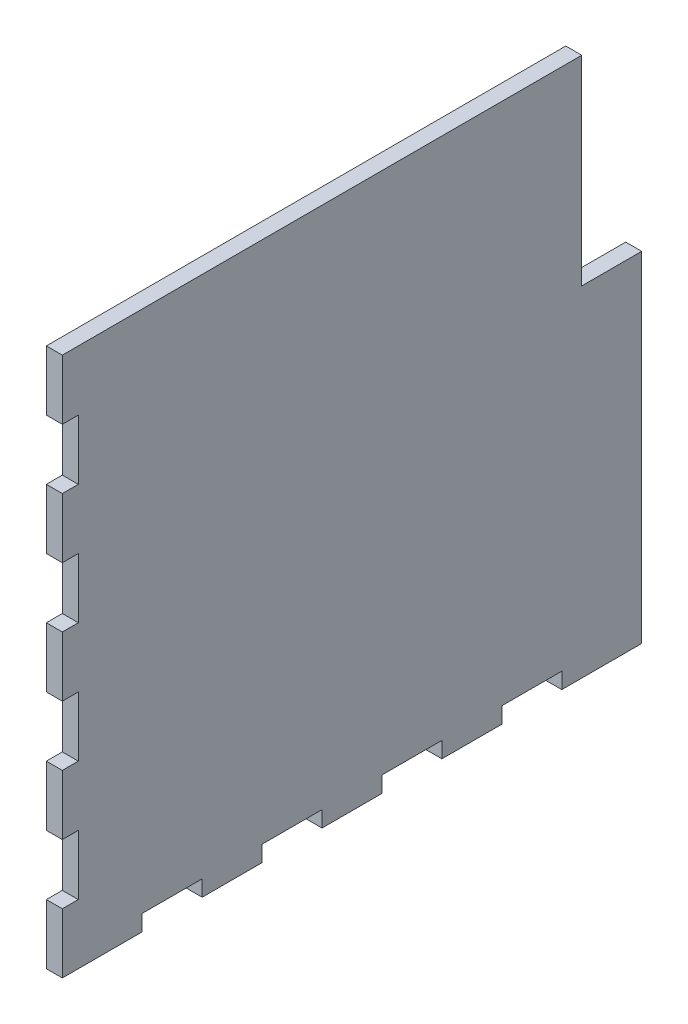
ISO-10303-21;
HEADER;
FILE_DESCRIPTION(('STEP AP214'),'2;1');
FILE_NAME('part.step','',(''),(''),'','','');
FILE_SCHEMA(('AUTOMOTIVE_DESIGN { 1 0 10303 214 1 1 1 1 }'));
ENDSEC;
DATA;
#1=APPLICATION_CONTEXT('core data for automotive mechanical design processes');
#2=APPLICATION_PROTOCOL_DEFINITION('international standard','automotive_design',2000,#1);
#3=PRODUCT_CONTEXT('',#1,'mechanical');
#4=PRODUCT('Part','Part','',(#3));
#5=PRODUCT_RELATED_PRODUCT_CATEGORY('part','',(#4));
#6=PRODUCT_DEFINITION_FORMATION('','',#4);
#7=PRODUCT_DEFINITION_CONTEXT('part definition',#1,'design');
#8=PRODUCT_DEFINITION('design','',#6,#7);
#9=PRODUCT_DEFINITION_SHAPE('','',#8);
#10=(LENGTH_UNIT() NAMED_UNIT(*) SI_UNIT(.MILLI.,.METRE.));
#11=(NAMED_UNIT(*) PLANE_ANGLE_UNIT() SI_UNIT($,.RADIAN.));
#12=(NAMED_UNIT(*) SI_UNIT($,.STERADIAN.) SOLID_ANGLE_UNIT());
#13=UNCERTAINTY_MEASURE_WITH_UNIT(LENGTH_MEASURE(1.E-05),#10,'distance_accuracy_value','');
#14=(GEOMETRIC_REPRESENTATION_CONTEXT(3) GLOBAL_UNCERTAINTY_ASSIGNED_CONTEXT((#13)) GLOBAL_UNIT_ASSIGNED_CONTEXT((#10,
#11,#12)) REPRESENTATION_CONTEXT('',''));
#15=CARTESIAN_POINT('',(0.,0.,0.));
#16=DIRECTION('',(0.,0.,1.));
#17=DIRECTION('',(1.,0.,0.));
#18=AXIS2_PLACEMENT_3D('',#15,#16,#17);
#19=CARTESIAN_POINT('',(4.,0.,0.));
#20=DIRECTION('',(0.,0.,1.));
#21=DIRECTION('',(0.,-1.,0.));
#22=AXIS2_PLACEMENT_3D('',#19,#20,#21);
#23=PLANE('',#22);
#24=DIRECTION('',(1.,0.,0.));
#25=VECTOR('',#24,1.);
#26=CARTESIAN_POINT('',(0.,120.,0.));
#27=LINE('',#26,#25);
#28=CARTESIAN_POINT('',(0.,120.,0.));
#29=VERTEX_POINT('',#28);
#30=CARTESIAN_POINT('',(4.,120.,0.));
#31=VERTEX_POINT('',#30);
#32=EDGE_CURVE('E664',#29,#31,#27,.T.);
#33=ORIENTED_EDGE('',*,*,#32,.T.);
#34=DIRECTION('',(0.,1.,0.));
#35=VECTOR('',#34,1.);
#36=CARTESIAN_POINT('',(4.,0.,0.));
#37=LINE('',#36,#35);
#38=CARTESIAN_POINT('',(4.,135.,0.));
#39=VERTEX_POINT('',#38);
#40=EDGE_CURVE('E528',#31,#39,#37,.T.);
#41=ORIENTED_EDGE('',*,*,#40,.T.);
#42=DIRECTION('',(-1.,0.,0.));
#43=VECTOR('',#42,1.);
#44=CARTESIAN_POINT('',(4.,135.,0.));
#45=LINE('',#44,#43);
#46=CARTESIAN_POINT('',(0.,135.,0.));
#47=VERTEX_POINT('',#46);
#48=EDGE_CURVE('E346',#39,#47,#45,.T.);
#49=ORIENTED_EDGE('',*,*,#48,.T.);
#50=DIRECTION('',(0.,1.,0.));
#51=VECTOR('',#50,1.);
#52=CARTESIAN_POINT('',(0.,0.,0.));
#53=LINE('',#52,#51);
#54=EDGE_CURVE('E322',#29,#47,#53,.T.);
#55=ORIENTED_EDGE('',*,*,#54,.F.);
#56=EDGE_LOOP('',(#33,#41,#49,#55));
#57=FACE_BOUND('',#56,.T.);
#58=ADVANCED_FACE('F45',(#57),#23,.T.);
#59=DIRECTION('',(1.,0.,0.));
#60=VECTOR('',#59,1.);
#61=CARTESIAN_POINT('',(0.,105.,0.));
#62=LINE('',#61,#60);
#63=CARTESIAN_POINT('',(0.,105.,0.));
#64=VERTEX_POINT('',#63);
#65=CARTESIAN_POINT('',(4.,105.,0.));
#66=VERTEX_POINT('',#65);
#67=EDGE_CURVE('E296',#64,#66,#62,.T.);
#68=ORIENTED_EDGE('',*,*,#67,.F.);
#69=CARTESIAN_POINT('',(0.,90.,0.));
#70=VERTEX_POINT('',#69);
#71=EDGE_CURVE('E309',#70,#64,#53,.T.);
#72=ORIENTED_EDGE('',*,*,#71,.F.);
#73=DIRECTION('',(1.,0.,0.));
#74=VECTOR('',#73,1.);
#75=CARTESIAN_POINT('',(0.,90.,0.));
#76=LINE('',#75,#74);
#77=CARTESIAN_POINT('',(4.,90.,0.));
#78=VERTEX_POINT('',#77);
#79=EDGE_CURVE('E714',#70,#78,#76,.T.);
#80=ORIENTED_EDGE('',*,*,#79,.T.);
#81=EDGE_CURVE('E311',#78,#66,#37,.T.);
#82=ORIENTED_EDGE('',*,*,#81,.T.);
#83=EDGE_LOOP('',(#68,#72,#80,#82));
#84=FACE_BOUND('',#83,.T.);
#85=ADVANCED_FACE('F307',(#84),#23,.T.);
#86=DIRECTION('',(1.,0.,0.));
#87=VECTOR('',#86,1.);
#88=CARTESIAN_POINT('',(0.,75.,0.));
#89=LINE('',#88,#87);
#90=CARTESIAN_POINT('',(0.,75.,0.));
#91=VERTEX_POINT('',#90);
#92=CARTESIAN_POINT('',(4.,75.,0.));
#93=VERTEX_POINT('',#92);
#94=EDGE_CURVE('E554',#91,#93,#89,.T.);
#95=ORIENTED_EDGE('',*,*,#94,.F.);
#96=CARTESIAN_POINT('',(0.,60.,0.));
#97=VERTEX_POINT('',#96);
#98=EDGE_CURVE('E321',#97,#91,#53,.T.);
#99=ORIENTED_EDGE('',*,*,#98,.F.);
#100=DIRECTION('',(1.,0.,0.));
#101=VECTOR('',#100,1.);
#102=CARTESIAN_POINT('',(0.,60.,0.));
#103=LINE('',#102,#101);
#104=CARTESIAN_POINT('',(4.,60.,0.));
#105=VERTEX_POINT('',#104);
#106=EDGE_CURVE('E555',#97,#105,#103,.T.);
#107=ORIENTED_EDGE('',*,*,#106,.T.);
#108=EDGE_CURVE('E539',#105,#93,#37,.T.);
#109=ORIENTED_EDGE('',*,*,#108,.T.);
#110=EDGE_LOOP('',(#95,#99,#107,#109));
#111=FACE_BOUND('',#110,.T.);
#112=ADVANCED_FACE('F552',(#111),#23,.T.);
#113=DIRECTION('',(1.,0.,0.));
#114=VECTOR('',#113,1.);
#115=CARTESIAN_POINT('',(0.,45.,0.));
#116=LINE('',#115,#114);
#117=CARTESIAN_POINT('',(0.,45.,0.));
#118=VERTEX_POINT('',#117);
#119=CARTESIAN_POINT('',(4.,45.,0.));
#120=VERTEX_POINT('',#119);
#121=EDGE_CURVE('E700',#118,#120,#116,.T.);
#122=ORIENTED_EDGE('',*,*,#121,.F.);
#123=CARTESIAN_POINT('',(0.,30.,0.));
#124=VERTEX_POINT('',#123);
#125=EDGE_CURVE('E327',#124,#118,#53,.T.);
#126=ORIENTED_EDGE('',*,*,#125,.F.);
#127=DIRECTION('',(1.,0.,0.));
#128=VECTOR('',#127,1.);
#129=CARTESIAN_POINT('',(0.,30.,0.));
#130=LINE('',#129,#128);
#131=CARTESIAN_POINT('',(4.,30.,0.));
#132=VERTEX_POINT('',#131);
#133=EDGE_CURVE('E726',#124,#132,#130,.T.);
#134=ORIENTED_EDGE('',*,*,#133,.T.);
#135=EDGE_CURVE('E532',#132,#120,#37,.T.);
#136=ORIENTED_EDGE('',*,*,#135,.T.);
#137=EDGE_LOOP('',(#122,#126,#134,#136));
#138=FACE_BOUND('',#137,.T.);
#139=ADVANCED_FACE('F747',(#138),#23,.T.);
#140=CARTESIAN_POINT('',(4.,0.,-145.));
#141=DIRECTION('',(0.,-1.,0.));
#142=DIRECTION('',(0.,0.,-1.));
#143=AXIS2_PLACEMENT_3D('',#140,#141,#142);
#144=PLANE('',#143);
#145=DIRECTION('',(1.,0.,0.));
#146=VECTOR('',#145,1.);
#147=CARTESIAN_POINT('',(0.,0.,-20.));
#148=LINE('',#147,#146);
#149=CARTESIAN_POINT('',(0.,0.,-20.));
#150=VERTEX_POINT('',#149);
#151=CARTESIAN_POINT('',(4.,0.,-20.));
#152=VERTEX_POINT('',#151);
#153=EDGE_CURVE('E601',#150,#152,#148,.T.);
#154=ORIENTED_EDGE('',*,*,#153,.T.);
#155=DIRECTION('',(0.,0.,1.));
#156=VECTOR('',#155,1.);
#157=CARTESIAN_POINT('',(4.,0.,-145.));
#158=LINE('',#157,#156);
#159=CARTESIAN_POINT('',(4.,0.,0.));
#160=VERTEX_POINT('',#159);
#161=EDGE_CURVE('E524',#152,#160,#158,.T.);
#162=ORIENTED_EDGE('',*,*,#161,.T.);
#163=DIRECTION('',(-1.,0.,0.));
#164=VECTOR('',#163,1.);
#165=CARTESIAN_POINT('',(4.,0.,0.));
#166=LINE('',#165,#164);
#167=CARTESIAN_POINT('',(0.,0.,0.));
#168=VERTEX_POINT('',#167);
#169=EDGE_CURVE('E350',#160,#168,#166,.T.);
#170=ORIENTED_EDGE('',*,*,#169,.T.);
#171=DIRECTION('',(0.,0.,1.));
#172=VECTOR('',#171,1.);
#173=CARTESIAN_POINT('',(0.,0.,-145.));
#174=LINE('',#173,#172);
#175=EDGE_CURVE('E383',#150,#168,#174,.T.);
#176=ORIENTED_EDGE('',*,*,#175,.F.);
#177=EDGE_LOOP('',(#154,#162,#170,#176));
#178=FACE_BOUND('',#177,.T.);
#179=ADVANCED_FACE('F652',(#178),#144,.T.);
#180=DIRECTION('',(1.,0.,0.));
#181=VECTOR('',#180,1.);
#182=CARTESIAN_POINT('',(0.,0.,-80.0000000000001));
#183=LINE('',#182,#181);
#184=CARTESIAN_POINT('',(0.,0.,-80.0000000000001));
#185=VERTEX_POINT('',#184);
#186=CARTESIAN_POINT('',(4.,0.,-80.0000000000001));
#187=VERTEX_POINT('',#186);
#188=EDGE_CURVE('E415',#185,#187,#183,.T.);
#189=ORIENTED_EDGE('',*,*,#188,.T.);
#190=CARTESIAN_POINT('',(4.,0.,-65.));
#191=VERTEX_POINT('',#190);
#192=EDGE_CURVE('E418',#187,#191,#158,.T.);
#193=ORIENTED_EDGE('',*,*,#192,.T.);
#194=DIRECTION('',(1.,0.,0.));
#195=VECTOR('',#194,1.);
#196=CARTESIAN_POINT('',(0.,0.,-65.));
#197=LINE('',#196,#195);
#198=CARTESIAN_POINT('',(0.,0.,-65.));
#199=VERTEX_POINT('',#198);
#200=EDGE_CURVE('E417',#199,#191,#197,.T.);
#201=ORIENTED_EDGE('',*,*,#200,.F.);
#202=EDGE_CURVE('E391',#185,#199,#174,.T.);
#203=ORIENTED_EDGE('',*,*,#202,.F.);
#204=EDGE_LOOP('',(#189,#193,#201,#203));
#205=FACE_BOUND('',#204,.T.);
#206=ADVANCED_FACE('F413',(#205),#144,.T.);
#207=DIRECTION('',(1.,0.,0.));
#208=VECTOR('',#207,1.);
#209=CARTESIAN_POINT('',(0.,0.,-95.0000000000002));
#210=LINE('',#209,#208);
#211=CARTESIAN_POINT('',(0.,0.,-95.0000000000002));
#212=VERTEX_POINT('',#211);
#213=CARTESIAN_POINT('',(4.,0.,-95.0000000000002));
#214=VERTEX_POINT('',#213);
#215=EDGE_CURVE('E618',#212,#214,#210,.T.);
#216=ORIENTED_EDGE('',*,*,#215,.F.);
#217=CARTESIAN_POINT('',(0.,0.,-110.));
#218=VERTEX_POINT('',#217);
#219=EDGE_CURVE('E393',#218,#212,#174,.T.);
#220=ORIENTED_EDGE('',*,*,#219,.F.);
#221=DIRECTION('',(1.,0.,0.));
#222=VECTOR('',#221,1.);
#223=CARTESIAN_POINT('',(0.,0.,-110.));
#224=LINE('',#223,#222);
#225=CARTESIAN_POINT('',(4.,0.,-110.));
#226=VERTEX_POINT('',#225);
#227=EDGE_CURVE('E448',#218,#226,#224,.T.);
#228=ORIENTED_EDGE('',*,*,#227,.T.);
#229=EDGE_CURVE('E529',#226,#214,#158,.T.);
#230=ORIENTED_EDGE('',*,*,#229,.T.);
#231=EDGE_LOOP('',(#216,#220,#228,#230));
#232=FACE_BOUND('',#231,.T.);
#233=ADVANCED_FACE('F639',(#232),#144,.T.);
#234=DIRECTION('',(1.,0.,0.));
#235=VECTOR('',#234,1.);
#236=CARTESIAN_POINT('',(0.,0.,-35.));
#237=LINE('',#236,#235);
#238=CARTESIAN_POINT('',(0.,0.,-35.));
#239=VERTEX_POINT('',#238);
#240=CARTESIAN_POINT('',(4.,0.,-35.));
#241=VERTEX_POINT('',#240);
#242=EDGE_CURVE('E609',#239,#241,#237,.T.);
#243=ORIENTED_EDGE('',*,*,#242,.F.);
#244=CARTESIAN_POINT('',(0.,0.,-50.));
#245=VERTEX_POINT('',#244);
#246=EDGE_CURVE('E386',#245,#239,#174,.T.);
#247=ORIENTED_EDGE('',*,*,#246,.F.);
#248=DIRECTION('',(1.,0.,0.));
#249=VECTOR('',#248,1.);
#250=CARTESIAN_POINT('',(0.,0.,-50.));
#251=LINE('',#250,#249);
#252=CARTESIAN_POINT('',(4.,0.,-50.));
#253=VERTEX_POINT('',#252);
#254=EDGE_CURVE('E422',#245,#253,#251,.T.);
#255=ORIENTED_EDGE('',*,*,#254,.T.);
#256=EDGE_CURVE('E643',#253,#241,#158,.T.);
#257=ORIENTED_EDGE('',*,*,#256,.T.);
#258=EDGE_LOOP('',(#243,#247,#255,#257));
#259=FACE_BOUND('',#258,.T.);
#260=ADVANCED_FACE('F789',(#259),#144,.T.);
#261=CARTESIAN_POINT('',(4.,85.,-130.));
#262=DIRECTION('',(0.,1.,0.));
#263=DIRECTION('',(0.,0.,1.));
#264=AXIS2_PLACEMENT_3D('',#261,#262,#263);
#265=PLANE('',#264);
#266=DIRECTION('',(0.,0.,-1.));
#267=VECTOR('',#266,1.);
#268=CARTESIAN_POINT('',(0.,85.,-130.));
#269=LINE('',#268,#267);
#270=CARTESIAN_POINT('',(0.,85.,-130.));
#271=VERTEX_POINT('',#270);
#272=CARTESIAN_POINT('',(0.,85.,-145.));
#273=VERTEX_POINT('',#272);
#274=EDGE_CURVE('E376',#271,#273,#269,.T.);
#275=ORIENTED_EDGE('',*,*,#274,.F.);
#276=DIRECTION('',(-1.,0.,0.));
#277=VECTOR('',#276,1.);
#278=CARTESIAN_POINT('',(4.,85.,-130.));
#279=LINE('',#278,#277);
#280=CARTESIAN_POINT('',(4.,85.,-130.));
#281=VERTEX_POINT('',#280);
#282=EDGE_CURVE('E11',#281,#271,#279,.T.);
#283=ORIENTED_EDGE('',*,*,#282,.F.);
#284=DIRECTION('',(0.,0.,-1.));
#285=VECTOR('',#284,1.);
#286=CARTESIAN_POINT('',(4.,85.,-130.));
#287=LINE('',#286,#285);
#288=CARTESIAN_POINT('',(4.,85.,-145.));
#289=VERTEX_POINT('',#288);
#290=EDGE_CURVE('E342',#281,#289,#287,.T.);
#291=ORIENTED_EDGE('',*,*,#290,.T.);
#292=DIRECTION('',(-1.,0.,0.));
#293=VECTOR('',#292,1.);
#294=CARTESIAN_POINT('',(4.,85.,-145.));
#295=LINE('',#294,#293);
#296=EDGE_CURVE('E49',#289,#273,#295,.T.);
#297=ORIENTED_EDGE('',*,*,#296,.T.);
#298=EDGE_LOOP('',(#275,#283,#291,#297));
#299=FACE_BOUND('',#298,.T.);
#300=ADVANCED_FACE('F47',(#299),#265,.T.);
#301=CARTESIAN_POINT('',(4.,135.,-130.));
#302=DIRECTION('',(0.,0.,-1.));
#303=DIRECTION('',(0.,1.,0.));
#304=AXIS2_PLACEMENT_3D('',#301,#302,#303);
#305=PLANE('',#304);
#306=DIRECTION('',(0.,-1.,0.));
#307=VECTOR('',#306,1.);
#308=CARTESIAN_POINT('',(0.,135.,-130.));
#309=LINE('',#308,#307);
#310=CARTESIAN_POINT('',(0.,135.,-130.));
#311=VERTEX_POINT('',#310);
#312=EDGE_CURVE('E339',#311,#271,#309,.T.);
#313=ORIENTED_EDGE('',*,*,#312,.F.);
#314=DIRECTION('',(-1.,0.,0.));
#315=VECTOR('',#314,1.);
#316=CARTESIAN_POINT('',(4.,135.,-130.));
#317=LINE('',#316,#315);
#318=CARTESIAN_POINT('',(4.,135.,-130.));
#319=VERTEX_POINT('',#318);
#320=EDGE_CURVE('E55',#319,#311,#317,.T.);
#321=ORIENTED_EDGE('',*,*,#320,.F.);
#322=DIRECTION('',(0.,-1.,0.));
#323=VECTOR('',#322,1.);
#324=CARTESIAN_POINT('',(4.,135.,-130.));
#325=LINE('',#324,#323);
#326=EDGE_CURVE('E360',#319,#281,#325,.T.);
#327=ORIENTED_EDGE('',*,*,#326,.T.);
#328=ORIENTED_EDGE('',*,*,#282,.T.);
#329=EDGE_LOOP('',(#313,#321,#327,#328));
#330=FACE_BOUND('',#329,.T.);
#331=ADVANCED_FACE('F786',(#330),#305,.T.);
#332=CARTESIAN_POINT('',(4.,135.,0.));
#333=DIRECTION('',(0.,1.,0.));
#334=DIRECTION('',(0.,0.,1.));
#335=AXIS2_PLACEMENT_3D('',#332,#333,#334);
#336=PLANE('',#335);
#337=DIRECTION('',(0.,0.,-1.));
#338=VECTOR('',#337,1.);
#339=CARTESIAN_POINT('',(0.,135.,0.));
#340=LINE('',#339,#338);
#341=EDGE_CURVE('E334',#47,#311,#340,.T.);
#342=ORIENTED_EDGE('',*,*,#341,.F.);
#343=ORIENTED_EDGE('',*,*,#48,.F.);
#344=DIRECTION('',(0.,0.,-1.));
#345=VECTOR('',#344,1.);
#346=CARTESIAN_POINT('',(4.,135.,0.));
#347=LINE('',#346,#345);
#348=EDGE_CURVE('E366',#39,#319,#347,.T.);
#349=ORIENTED_EDGE('',*,*,#348,.T.);
#350=ORIENTED_EDGE('',*,*,#320,.T.);
#351=EDGE_LOOP('',(#342,#343,#349,#350));
#352=FACE_BOUND('',#351,.T.);
#353=ADVANCED_FACE('F784',(#352),#336,.T.);
#354=DIRECTION('',(1.,0.,0.));
#355=VECTOR('',#354,1.);
#356=CARTESIAN_POINT('',(0.,15.,0.));
#357=LINE('',#356,#355);
#358=CARTESIAN_POINT('',(0.,15.,0.));
#359=VERTEX_POINT('',#358);
#360=CARTESIAN_POINT('',(4.,15.,0.));
#361=VERTEX_POINT('',#360);
#362=EDGE_CURVE('E715',#359,#361,#357,.T.);
#363=ORIENTED_EDGE('',*,*,#362,.F.);
#364=EDGE_CURVE('E329',#168,#359,#53,.T.);
#365=ORIENTED_EDGE('',*,*,#364,.F.);
#366=ORIENTED_EDGE('',*,*,#169,.F.);
#367=EDGE_CURVE('E372',#160,#361,#37,.T.);
#368=ORIENTED_EDGE('',*,*,#367,.T.);
#369=EDGE_LOOP('',(#363,#365,#366,#368));
#370=FACE_BOUND('',#369,.T.);
#371=ADVANCED_FACE('F654',(#370),#23,.T.);
#372=DIRECTION('',(1.,0.,0.));
#373=VECTOR('',#372,1.);
#374=CARTESIAN_POINT('',(0.,0.,-125.));
#375=LINE('',#374,#373);
#376=CARTESIAN_POINT('',(0.,0.,-125.));
#377=VERTEX_POINT('',#376);
#378=CARTESIAN_POINT('',(4.,0.,-125.));
#379=VERTEX_POINT('',#378);
#380=EDGE_CURVE('E453',#377,#379,#375,.T.);
#381=ORIENTED_EDGE('',*,*,#380,.F.);
#382=CARTESIAN_POINT('',(0.,0.,-145.));
#383=VERTEX_POINT('',#382);
#384=EDGE_CURVE('E328',#383,#377,#174,.T.);
#385=ORIENTED_EDGE('',*,*,#384,.F.);
#386=DIRECTION('',(-1.,0.,0.));
#387=VECTOR('',#386,1.);
#388=CARTESIAN_POINT('',(4.,0.,-145.));
#389=LINE('',#388,#387);
#390=CARTESIAN_POINT('',(4.,0.,-145.));
#391=VERTEX_POINT('',#390);
#392=EDGE_CURVE('E353',#391,#383,#389,.T.);
#393=ORIENTED_EDGE('',*,*,#392,.F.);
#394=EDGE_CURVE('E525',#391,#379,#158,.T.);
#395=ORIENTED_EDGE('',*,*,#394,.T.);
#396=EDGE_LOOP('',(#381,#385,#393,#395));
#397=FACE_BOUND('',#396,.T.);
#398=ADVANCED_FACE('F796',(#397),#144,.T.);
#399=CARTESIAN_POINT('',(4.,85.,-145.));
#400=DIRECTION('',(0.,0.,-1.));
#401=DIRECTION('',(0.,1.,0.));
#402=AXIS2_PLACEMENT_3D('',#399,#400,#401);
#403=PLANE('',#402);
#404=DIRECTION('',(0.,-1.,0.));
#405=VECTOR('',#404,1.);
#406=CARTESIAN_POINT('',(0.,85.,-145.));
#407=LINE('',#406,#405);
#408=EDGE_CURVE('E379',#273,#383,#407,.T.);
#409=ORIENTED_EDGE('',*,*,#408,.F.);
#410=ORIENTED_EDGE('',*,*,#296,.F.);
#411=DIRECTION('',(0.,-1.,0.));
#412=VECTOR('',#411,1.);
#413=CARTESIAN_POINT('',(4.,85.,-145.));
#414=LINE('',#413,#412);
#415=EDGE_CURVE('E521',#289,#391,#414,.T.);
#416=ORIENTED_EDGE('',*,*,#415,.T.);
#417=ORIENTED_EDGE('',*,*,#392,.T.);
#418=EDGE_LOOP('',(#409,#410,#416,#417));
#419=FACE_BOUND('',#418,.T.);
#420=ADVANCED_FACE('F810',(#419),#403,.T.);
#421=CARTESIAN_POINT('',(4.,0.,0.));
#422=DIRECTION('',(-1.,0.,0.));
#423=DIRECTION('',(0.,0.,1.));
#424=AXIS2_PLACEMENT_3D('',#421,#422,#423);
#425=PLANE('',#424);
#426=ORIENTED_EDGE('',*,*,#40,.F.);
#427=DIRECTION('',(0.,0.,-1.));
#428=VECTOR('',#427,1.);
#429=CARTESIAN_POINT('',(4.,120.,0.));
#430=LINE('',#429,#428);
#431=CARTESIAN_POINT('',(4.,120.,-4.));
#432=VERTEX_POINT('',#431);
#433=EDGE_CURVE('E586',#31,#432,#430,.T.);
#434=ORIENTED_EDGE('',*,*,#433,.T.);
#435=DIRECTION('',(0.,-1.,0.));
#436=VECTOR('',#435,1.);
#437=CARTESIAN_POINT('',(4.,0.,-4.00000000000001));
#438=LINE('',#437,#436);
#439=CARTESIAN_POINT('',(4.,105.,-4.));
#440=VERTEX_POINT('',#439);
#441=EDGE_CURVE('E582',#432,#440,#438,.T.);
#442=ORIENTED_EDGE('',*,*,#441,.T.);
#443=DIRECTION('',(0.,0.,1.));
#444=VECTOR('',#443,1.);
#445=CARTESIAN_POINT('',(4.,105.,0.));
#446=LINE('',#445,#444);
#447=EDGE_CURVE('E579',#440,#66,#446,.T.);
#448=ORIENTED_EDGE('',*,*,#447,.T.);
#449=ORIENTED_EDGE('',*,*,#81,.F.);
#450=DIRECTION('',(0.,0.,-1.));
#451=VECTOR('',#450,1.);
#452=CARTESIAN_POINT('',(4.,90.,0.));
#453=LINE('',#452,#451);
#454=CARTESIAN_POINT('',(4.,90.,-4.00000000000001));
#455=VERTEX_POINT('',#454);
#456=EDGE_CURVE('E571',#78,#455,#453,.T.);
#457=ORIENTED_EDGE('',*,*,#456,.T.);
#458=DIRECTION('',(0.,-1.,0.));
#459=VECTOR('',#458,1.);
#460=CARTESIAN_POINT('',(4.,0.,-4.00000000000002));
#461=LINE('',#460,#459);
#462=CARTESIAN_POINT('',(4.,75.,-4.00000000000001));
#463=VERTEX_POINT('',#462);
#464=EDGE_CURVE('E565',#455,#463,#461,.T.);
#465=ORIENTED_EDGE('',*,*,#464,.T.);
#466=DIRECTION('',(0.,0.,1.));
#467=VECTOR('',#466,1.);
#468=CARTESIAN_POINT('',(4.,75.,0.));
#469=LINE('',#468,#467);
#470=EDGE_CURVE('E563',#463,#93,#469,.T.);
#471=ORIENTED_EDGE('',*,*,#470,.T.);
#472=ORIENTED_EDGE('',*,*,#108,.F.);
#473=DIRECTION('',(0.,0.,-1.));
#474=VECTOR('',#473,1.);
#475=CARTESIAN_POINT('',(4.,60.,0.));
#476=LINE('',#475,#474);
#477=CARTESIAN_POINT('',(4.,60.,-4.00000000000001));
#478=VERTEX_POINT('',#477);
#479=EDGE_CURVE('E561',#105,#478,#476,.T.);
#480=ORIENTED_EDGE('',*,*,#479,.T.);
#481=DIRECTION('',(0.,-1.,0.));
#482=VECTOR('',#481,1.);
#483=CARTESIAN_POINT('',(4.,0.,-4.00000000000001));
#484=LINE('',#483,#482);
#485=CARTESIAN_POINT('',(4.,45.,-4.00000000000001));
#486=VERTEX_POINT('',#485);
#487=EDGE_CURVE('E573',#478,#486,#484,.T.);
#488=ORIENTED_EDGE('',*,*,#487,.T.);
#489=DIRECTION('',(0.,0.,1.));
#490=VECTOR('',#489,1.);
#491=CARTESIAN_POINT('',(4.,45.,0.));
#492=LINE('',#491,#490);
#493=EDGE_CURVE('E678',#486,#120,#492,.T.);
#494=ORIENTED_EDGE('',*,*,#493,.T.);
#495=ORIENTED_EDGE('',*,*,#135,.F.);
#496=DIRECTION('',(0.,0.,-1.));
#497=VECTOR('',#496,1.);
#498=CARTESIAN_POINT('',(4.,30.,0.));
#499=LINE('',#498,#497);
#500=CARTESIAN_POINT('',(4.,30.,-4.));
#501=VERTEX_POINT('',#500);
#502=EDGE_CURVE('E668',#132,#501,#499,.T.);
#503=ORIENTED_EDGE('',*,*,#502,.T.);
#504=DIRECTION('',(0.,-1.,0.));
#505=VECTOR('',#504,1.);
#506=CARTESIAN_POINT('',(4.,0.,-3.99999999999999));
#507=LINE('',#506,#505);
#508=CARTESIAN_POINT('',(4.,15.,-3.99999999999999));
#509=VERTEX_POINT('',#508);
#510=EDGE_CURVE('E659',#501,#509,#507,.T.);
#511=ORIENTED_EDGE('',*,*,#510,.T.);
#512=DIRECTION('',(0.,0.,1.));
#513=VECTOR('',#512,1.);
#514=CARTESIAN_POINT('',(4.,15.,0.));
#515=LINE('',#514,#513);
#516=EDGE_CURVE('E657',#509,#361,#515,.T.);
#517=ORIENTED_EDGE('',*,*,#516,.T.);
#518=ORIENTED_EDGE('',*,*,#367,.F.);
#519=ORIENTED_EDGE('',*,*,#161,.F.);
#520=DIRECTION('',(0.,1.,0.));
#521=VECTOR('',#520,1.);
#522=CARTESIAN_POINT('',(4.,0.,-20.));
#523=LINE('',#522,#521);
#524=CARTESIAN_POINT('',(4.,3.99999999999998,-20.));
#525=VERTEX_POINT('',#524);
#526=EDGE_CURVE('E380',#152,#525,#523,.T.);
#527=ORIENTED_EDGE('',*,*,#526,.T.);
#528=DIRECTION('',(0.,0.,-1.));
#529=VECTOR('',#528,1.);
#530=CARTESIAN_POINT('',(4.,3.99999999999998,0.));
#531=LINE('',#530,#529);
#532=CARTESIAN_POINT('',(4.,3.99999999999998,-35.));
#533=VERTEX_POINT('',#532);
#534=EDGE_CURVE('E512',#525,#533,#531,.T.);
#535=ORIENTED_EDGE('',*,*,#534,.T.);
#536=DIRECTION('',(0.,-1.,0.));
#537=VECTOR('',#536,1.);
#538=CARTESIAN_POINT('',(4.,0.,-35.));
#539=LINE('',#538,#537);
#540=EDGE_CURVE('E508',#533,#241,#539,.T.);
#541=ORIENTED_EDGE('',*,*,#540,.T.);
#542=ORIENTED_EDGE('',*,*,#256,.F.);
#543=DIRECTION('',(0.,1.,0.));
#544=VECTOR('',#543,1.);
#545=CARTESIAN_POINT('',(4.,0.,-50.));
#546=LINE('',#545,#544);
#547=CARTESIAN_POINT('',(4.,3.99999999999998,-50.));
#548=VERTEX_POINT('',#547);
#549=EDGE_CURVE('E480',#253,#548,#546,.T.);
#550=ORIENTED_EDGE('',*,*,#549,.T.);
#551=DIRECTION('',(0.,0.,-1.));
#552=VECTOR('',#551,1.);
#553=CARTESIAN_POINT('',(4.,3.99999999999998,0.));
#554=LINE('',#553,#552);
#555=CARTESIAN_POINT('',(4.,3.99999999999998,-65.));
#556=VERTEX_POINT('',#555);
#557=EDGE_CURVE('E475',#548,#556,#554,.T.);
#558=ORIENTED_EDGE('',*,*,#557,.T.);
#559=DIRECTION('',(0.,-1.,0.));
#560=VECTOR('',#559,1.);
#561=CARTESIAN_POINT('',(4.,0.,-65.));
#562=LINE('',#561,#560);
#563=EDGE_CURVE('E472',#556,#191,#562,.T.);
#564=ORIENTED_EDGE('',*,*,#563,.T.);
#565=ORIENTED_EDGE('',*,*,#192,.F.);
#566=DIRECTION('',(0.,1.,0.));
#567=VECTOR('',#566,1.);
#568=CARTESIAN_POINT('',(4.,0.,-80.0000000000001));
#569=LINE('',#568,#567);
#570=CARTESIAN_POINT('',(4.,3.99999999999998,-80.0000000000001));
#571=VERTEX_POINT('',#570);
#572=EDGE_CURVE('E504',#187,#571,#569,.T.);
#573=ORIENTED_EDGE('',*,*,#572,.T.);
#574=DIRECTION('',(0.,0.,-1.));
#575=VECTOR('',#574,1.);
#576=CARTESIAN_POINT('',(4.,3.99999999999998,0.));
#577=LINE('',#576,#575);
#578=CARTESIAN_POINT('',(4.,3.99999999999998,-95.0000000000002));
#579=VERTEX_POINT('',#578);
#580=EDGE_CURVE('E500',#571,#579,#577,.T.);
#581=ORIENTED_EDGE('',*,*,#580,.T.);
#582=DIRECTION('',(0.,-1.,0.));
#583=VECTOR('',#582,1.);
#584=CARTESIAN_POINT('',(4.,0.,-95.0000000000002));
#585=LINE('',#584,#583);
#586=EDGE_CURVE('E496',#579,#214,#585,.T.);
#587=ORIENTED_EDGE('',*,*,#586,.T.);
#588=ORIENTED_EDGE('',*,*,#229,.F.);
#589=DIRECTION('',(0.,1.,0.));
#590=VECTOR('',#589,1.);
#591=CARTESIAN_POINT('',(4.,0.,-110.));
#592=LINE('',#591,#590);
#593=CARTESIAN_POINT('',(4.,3.99999999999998,-110.));
#594=VERTEX_POINT('',#593);
#595=EDGE_CURVE('E492',#226,#594,#592,.T.);
#596=ORIENTED_EDGE('',*,*,#595,.T.);
#597=DIRECTION('',(0.,0.,-1.));
#598=VECTOR('',#597,1.);
#599=CARTESIAN_POINT('',(4.,3.99999999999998,0.));
#600=LINE('',#599,#598);
#601=CARTESIAN_POINT('',(4.,3.99999999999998,-125.));
#602=VERTEX_POINT('',#601);
#603=EDGE_CURVE('E488',#594,#602,#600,.T.);
#604=ORIENTED_EDGE('',*,*,#603,.T.);
#605=DIRECTION('',(0.,-1.,0.));
#606=VECTOR('',#605,1.);
#607=CARTESIAN_POINT('',(4.,-8.67361737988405E-13,-125.));
#608=LINE('',#607,#606);
#609=EDGE_CURVE('E484',#602,#379,#608,.T.);
#610=ORIENTED_EDGE('',*,*,#609,.T.);
#611=ORIENTED_EDGE('',*,*,#394,.F.);
#612=ORIENTED_EDGE('',*,*,#415,.F.);
#613=ORIENTED_EDGE('',*,*,#290,.F.);
#614=ORIENTED_EDGE('',*,*,#326,.F.);
#615=ORIENTED_EDGE('',*,*,#348,.F.);
#616=EDGE_LOOP('',(#426,#434,#442,#448,#449,#457,#465,#471,#472,#480,#488,#494,#495,#503,#511,
#517,#518,#519,#527,#535,#541,#542,#550,#558,#564,#565,#573,#581,#587,#588,#596,#604,#610,#611,
#612,#613,#614,#615));
#617=FACE_BOUND('',#616,.T.);
#618=ADVANCED_FACE('F559',(#617),#425,.F.);
#619=CARTESIAN_POINT('',(0.,0.,0.));
#620=DIRECTION('',(-1.,0.,0.));
#621=DIRECTION('',(0.,0.,1.));
#622=AXIS2_PLACEMENT_3D('',#619,#620,#621);
#623=PLANE('',#622);
#624=DIRECTION('',(0.,0.,1.));
#625=VECTOR('',#624,1.);
#626=CARTESIAN_POINT('',(0.,120.,0.));
#627=LINE('',#626,#625);
#628=CARTESIAN_POINT('',(0.,120.,-4.));
#629=VERTEX_POINT('',#628);
#630=EDGE_CURVE('E313',#629,#29,#627,.T.);
#631=ORIENTED_EDGE('',*,*,#630,.T.);
#632=ORIENTED_EDGE('',*,*,#54,.T.);
#633=ORIENTED_EDGE('',*,*,#341,.T.);
#634=ORIENTED_EDGE('',*,*,#312,.T.);
#635=ORIENTED_EDGE('',*,*,#274,.T.);
#636=ORIENTED_EDGE('',*,*,#408,.T.);
#637=ORIENTED_EDGE('',*,*,#384,.T.);
#638=DIRECTION('',(0.,1.,0.));
#639=VECTOR('',#638,1.);
#640=CARTESIAN_POINT('',(0.,0.,-125.));
#641=LINE('',#640,#639);
#642=CARTESIAN_POINT('',(0.,3.99999999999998,-125.));
#643=VERTEX_POINT('',#642);
#644=EDGE_CURVE('E467',#377,#643,#641,.T.);
#645=ORIENTED_EDGE('',*,*,#644,.T.);
#646=DIRECTION('',(0.,0.,1.));
#647=VECTOR('',#646,1.);
#648=CARTESIAN_POINT('',(0.,3.99999999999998,-110.));
#649=LINE('',#648,#647);
#650=CARTESIAN_POINT('',(0.,3.99999999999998,-110.));
#651=VERTEX_POINT('',#650);
#652=EDGE_CURVE('E452',#643,#651,#649,.T.);
#653=ORIENTED_EDGE('',*,*,#652,.T.);
#654=DIRECTION('',(0.,-1.,0.));
#655=VECTOR('',#654,1.);
#656=CARTESIAN_POINT('',(0.,0.,-110.));
#657=LINE('',#656,#655);
#658=EDGE_CURVE('E438',#651,#218,#657,.T.);
#659=ORIENTED_EDGE('',*,*,#658,.T.);
#660=ORIENTED_EDGE('',*,*,#219,.T.);
#661=DIRECTION('',(0.,1.,0.));
#662=VECTOR('',#661,1.);
#663=CARTESIAN_POINT('',(0.,0.,-95.0000000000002));
#664=LINE('',#663,#662);
#665=CARTESIAN_POINT('',(0.,3.99999999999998,-95.0000000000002));
#666=VERTEX_POINT('',#665);
#667=EDGE_CURVE('E630',#212,#666,#664,.T.);
#668=ORIENTED_EDGE('',*,*,#667,.T.);
#669=DIRECTION('',(0.,0.,1.));
#670=VECTOR('',#669,1.);
#671=CARTESIAN_POINT('',(0.,3.99999999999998,-80.0000000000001));
#672=LINE('',#671,#670);
#673=CARTESIAN_POINT('',(0.,3.99999999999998,-80.0000000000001));
#674=VERTEX_POINT('',#673);
#675=EDGE_CURVE('E617',#666,#674,#672,.T.);
#676=ORIENTED_EDGE('',*,*,#675,.T.);
#677=DIRECTION('',(0.,-1.,0.));
#678=VECTOR('',#677,1.);
#679=CARTESIAN_POINT('',(0.,0.,-80.0000000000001));
#680=LINE('',#679,#678);
#681=EDGE_CURVE('E409',#674,#185,#680,.T.);
#682=ORIENTED_EDGE('',*,*,#681,.T.);
#683=ORIENTED_EDGE('',*,*,#202,.T.);
#684=DIRECTION('',(0.,1.,0.));
#685=VECTOR('',#684,1.);
#686=CARTESIAN_POINT('',(0.,0.,-65.));
#687=LINE('',#686,#685);
#688=CARTESIAN_POINT('',(0.,3.99999999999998,-65.));
#689=VERTEX_POINT('',#688);
#690=EDGE_CURVE('E406',#199,#689,#687,.T.);
#691=ORIENTED_EDGE('',*,*,#690,.T.);
#692=DIRECTION('',(0.,0.,1.));
#693=VECTOR('',#692,1.);
#694=CARTESIAN_POINT('',(0.,3.99999999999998,-50.));
#695=LINE('',#694,#693);
#696=CARTESIAN_POINT('',(0.,3.99999999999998,-50.));
#697=VERTEX_POINT('',#696);
#698=EDGE_CURVE('E428',#689,#697,#695,.T.);
#699=ORIENTED_EDGE('',*,*,#698,.T.);
#700=DIRECTION('',(0.,-1.,0.));
#701=VECTOR('',#700,1.);
#702=CARTESIAN_POINT('',(0.,0.,-50.));
#703=LINE('',#702,#701);
#704=EDGE_CURVE('E443',#697,#245,#703,.T.);
#705=ORIENTED_EDGE('',*,*,#704,.T.);
#706=ORIENTED_EDGE('',*,*,#246,.T.);
#707=DIRECTION('',(0.,1.,0.));
#708=VECTOR('',#707,1.);
#709=CARTESIAN_POINT('',(0.,0.,-35.));
#710=LINE('',#709,#708);
#711=CARTESIAN_POINT('',(0.,3.99999999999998,-35.));
#712=VERTEX_POINT('',#711);
#713=EDGE_CURVE('E593',#239,#712,#710,.T.);
#714=ORIENTED_EDGE('',*,*,#713,.T.);
#715=DIRECTION('',(0.,0.,1.));
#716=VECTOR('',#715,1.);
#717=CARTESIAN_POINT('',(0.,3.99999999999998,-20.));
#718=LINE('',#717,#716);
#719=CARTESIAN_POINT('',(0.,3.99999999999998,-20.));
#720=VERTEX_POINT('',#719);
#721=EDGE_CURVE('E597',#712,#720,#718,.T.);
#722=ORIENTED_EDGE('',*,*,#721,.T.);
#723=DIRECTION('',(0.,-1.,0.));
#724=VECTOR('',#723,1.);
#725=CARTESIAN_POINT('',(0.,0.,-20.));
#726=LINE('',#725,#724);
#727=EDGE_CURVE('E447',#720,#150,#726,.T.);
#728=ORIENTED_EDGE('',*,*,#727,.T.);
#729=ORIENTED_EDGE('',*,*,#175,.T.);
#730=ORIENTED_EDGE('',*,*,#364,.T.);
#731=DIRECTION('',(0.,0.,-1.));
#732=VECTOR('',#731,1.);
#733=CARTESIAN_POINT('',(0.,15.,0.));
#734=LINE('',#733,#732);
#735=CARTESIAN_POINT('',(0.,15.,-3.99999999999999));
#736=VERTEX_POINT('',#735);
#737=EDGE_CURVE('E673',#359,#736,#734,.T.);
#738=ORIENTED_EDGE('',*,*,#737,.T.);
#739=DIRECTION('',(0.,1.,0.));
#740=VECTOR('',#739,1.);
#741=CARTESIAN_POINT('',(0.,30.,-4.));
#742=LINE('',#741,#740);
#743=CARTESIAN_POINT('',(0.,30.,-4.));
#744=VERTEX_POINT('',#743);
#745=EDGE_CURVE('E732',#736,#744,#742,.T.);
#746=ORIENTED_EDGE('',*,*,#745,.T.);
#747=DIRECTION('',(0.,0.,1.));
#748=VECTOR('',#747,1.);
#749=CARTESIAN_POINT('',(0.,30.,0.));
#750=LINE('',#749,#748);
#751=EDGE_CURVE('E718',#744,#124,#750,.T.);
#752=ORIENTED_EDGE('',*,*,#751,.T.);
#753=ORIENTED_EDGE('',*,*,#125,.T.);
#754=DIRECTION('',(0.,0.,-1.));
#755=VECTOR('',#754,1.);
#756=CARTESIAN_POINT('',(0.,45.,0.));
#757=LINE('',#756,#755);
#758=CARTESIAN_POINT('',(0.,45.,-4.00000000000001));
#759=VERTEX_POINT('',#758);
#760=EDGE_CURVE('E710',#118,#759,#757,.T.);
#761=ORIENTED_EDGE('',*,*,#760,.T.);
#762=DIRECTION('',(0.,1.,0.));
#763=VECTOR('',#762,1.);
#764=CARTESIAN_POINT('',(0.,60.,-4.00000000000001));
#765=LINE('',#764,#763);
#766=CARTESIAN_POINT('',(0.,60.,-4.00000000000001));
#767=VERTEX_POINT('',#766);
#768=EDGE_CURVE('E707',#759,#767,#765,.T.);
#769=ORIENTED_EDGE('',*,*,#768,.T.);
#770=DIRECTION('',(0.,0.,1.));
#771=VECTOR('',#770,1.);
#772=CARTESIAN_POINT('',(0.,60.,0.));
#773=LINE('',#772,#771);
#774=EDGE_CURVE('E694',#767,#97,#773,.T.);
#775=ORIENTED_EDGE('',*,*,#774,.T.);
#776=ORIENTED_EDGE('',*,*,#98,.T.);
#777=DIRECTION('',(0.,0.,-1.));
#778=VECTOR('',#777,1.);
#779=CARTESIAN_POINT('',(0.,75.,0.));
#780=LINE('',#779,#778);
#781=CARTESIAN_POINT('',(0.,75.,-4.00000000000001));
#782=VERTEX_POINT('',#781);
#783=EDGE_CURVE('E302',#91,#782,#780,.T.);
#784=ORIENTED_EDGE('',*,*,#783,.T.);
#785=DIRECTION('',(0.,1.,0.));
#786=VECTOR('',#785,1.);
#787=CARTESIAN_POINT('',(0.,90.,-4.00000000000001));
#788=LINE('',#787,#786);
#789=CARTESIAN_POINT('',(0.,90.,-4.00000000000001));
#790=VERTEX_POINT('',#789);
#791=EDGE_CURVE('E71',#782,#790,#788,.T.);
#792=ORIENTED_EDGE('',*,*,#791,.T.);
#793=DIRECTION('',(0.,0.,1.));
#794=VECTOR('',#793,1.);
#795=CARTESIAN_POINT('',(0.,90.,0.));
#796=LINE('',#795,#794);
#797=EDGE_CURVE('E319',#790,#70,#796,.T.);
#798=ORIENTED_EDGE('',*,*,#797,.T.);
#799=ORIENTED_EDGE('',*,*,#71,.T.);
#800=DIRECTION('',(0.,0.,-1.));
#801=VECTOR('',#800,1.);
#802=CARTESIAN_POINT('',(0.,105.,0.));
#803=LINE('',#802,#801);
#804=CARTESIAN_POINT('',(0.,105.,-4.));
#805=VERTEX_POINT('',#804);
#806=EDGE_CURVE('E293',#64,#805,#803,.T.);
#807=ORIENTED_EDGE('',*,*,#806,.T.);
#808=DIRECTION('',(0.,1.,0.));
#809=VECTOR('',#808,1.);
#810=CARTESIAN_POINT('',(0.,120.,-4.));
#811=LINE('',#810,#809);
#812=EDGE_CURVE('E63',#805,#629,#811,.T.);
#813=ORIENTED_EDGE('',*,*,#812,.T.);
#814=EDGE_LOOP('',(#631,#632,#633,#634,#635,#636,#637,#645,#653,#659,#660,#668,#676,#682,#683,
#691,#699,#705,#706,#714,#722,#728,#729,#730,#738,#746,#752,#753,#761,#769,#775,#776,#784,#792,
#798,#799,#807,#813));
#815=FACE_BOUND('',#814,.T.);
#816=ADVANCED_FACE('F317',(#815),#623,.T.);
#817=CARTESIAN_POINT('',(0.,0.,-50.));
#818=DIRECTION('',(0.,0.,1.));
#819=DIRECTION('',(1.,0.,0.));
#820=AXIS2_PLACEMENT_3D('',#817,#818,#819);
#821=PLANE('',#820);
#822=ORIENTED_EDGE('',*,*,#254,.F.);
#823=ORIENTED_EDGE('',*,*,#704,.F.);
#824=DIRECTION('',(1.,0.,0.));
#825=VECTOR('',#824,1.);
#826=CARTESIAN_POINT('',(0.,3.99999999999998,-50.));
#827=LINE('',#826,#825);
#828=EDGE_CURVE('E431',#697,#548,#827,.T.);
#829=ORIENTED_EDGE('',*,*,#828,.T.);
#830=ORIENTED_EDGE('',*,*,#549,.F.);
#831=EDGE_LOOP('',(#822,#823,#829,#830));
#832=FACE_BOUND('',#831,.T.);
#833=ADVANCED_FACE('F941',(#832),#821,.F.);
#834=CARTESIAN_POINT('',(0.,3.99999999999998,-50.));
#835=DIRECTION('',(0.,1.,0.));
#836=DIRECTION('',(0.,0.,1.));
#837=AXIS2_PLACEMENT_3D('',#834,#835,#836);
#838=PLANE('',#837);
#839=ORIENTED_EDGE('',*,*,#828,.F.);
#840=ORIENTED_EDGE('',*,*,#698,.F.);
#841=DIRECTION('',(1.,0.,0.));
#842=VECTOR('',#841,1.);
#843=CARTESIAN_POINT('',(0.,3.99999999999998,-65.));
#844=LINE('',#843,#842);
#845=EDGE_CURVE('E423',#689,#556,#844,.T.);
#846=ORIENTED_EDGE('',*,*,#845,.T.);
#847=ORIENTED_EDGE('',*,*,#557,.F.);
#848=EDGE_LOOP('',(#839,#840,#846,#847));
#849=FACE_BOUND('',#848,.T.);
#850=ADVANCED_FACE('F994',(#849),#838,.F.);
#851=CARTESIAN_POINT('',(0.,0.,-65.));
#852=DIRECTION('',(0.,0.,-1.));
#853=DIRECTION('',(-1.,0.,0.));
#854=AXIS2_PLACEMENT_3D('',#851,#852,#853);
#855=PLANE('',#854);
#856=ORIENTED_EDGE('',*,*,#845,.F.);
#857=ORIENTED_EDGE('',*,*,#690,.F.);
#858=ORIENTED_EDGE('',*,*,#200,.T.);
#859=ORIENTED_EDGE('',*,*,#563,.F.);
#860=EDGE_LOOP('',(#856,#857,#858,#859));
#861=FACE_BOUND('',#860,.T.);
#862=ADVANCED_FACE('F1004',(#861),#855,.F.);
#863=CARTESIAN_POINT('',(0.,0.,-110.));
#864=DIRECTION('',(0.,0.,1.));
#865=DIRECTION('',(1.,0.,0.));
#866=AXIS2_PLACEMENT_3D('',#863,#864,#865);
#867=PLANE('',#866);
#868=ORIENTED_EDGE('',*,*,#227,.F.);
#869=ORIENTED_EDGE('',*,*,#658,.F.);
#870=DIRECTION('',(1.,0.,0.));
#871=VECTOR('',#870,1.);
#872=CARTESIAN_POINT('',(0.,3.99999999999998,-110.));
#873=LINE('',#872,#871);
#874=EDGE_CURVE('E460',#651,#594,#873,.T.);
#875=ORIENTED_EDGE('',*,*,#874,.T.);
#876=ORIENTED_EDGE('',*,*,#595,.F.);
#877=EDGE_LOOP('',(#868,#869,#875,#876));
#878=FACE_BOUND('',#877,.T.);
#879=ADVANCED_FACE('F1013',(#878),#867,.F.);
#880=CARTESIAN_POINT('',(0.,3.99999999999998,-110.));
#881=DIRECTION('',(0.,1.,0.));
#882=DIRECTION('',(0.,0.,1.));
#883=AXIS2_PLACEMENT_3D('',#880,#881,#882);
#884=PLANE('',#883);
#885=ORIENTED_EDGE('',*,*,#874,.F.);
#886=ORIENTED_EDGE('',*,*,#652,.F.);
#887=DIRECTION('',(1.,0.,0.));
#888=VECTOR('',#887,1.);
#889=CARTESIAN_POINT('',(0.,3.99999999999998,-125.));
#890=LINE('',#889,#888);
#891=EDGE_CURVE('E456',#643,#602,#890,.T.);
#892=ORIENTED_EDGE('',*,*,#891,.T.);
#893=ORIENTED_EDGE('',*,*,#603,.F.);
#894=EDGE_LOOP('',(#885,#886,#892,#893));
#895=FACE_BOUND('',#894,.T.);
#896=ADVANCED_FACE('F1021',(#895),#884,.F.);
#897=CARTESIAN_POINT('',(0.,0.,-125.));
#898=DIRECTION('',(0.,0.,-1.));
#899=DIRECTION('',(0.,1.,0.));
#900=AXIS2_PLACEMENT_3D('',#897,#898,#899);
#901=PLANE('',#900);
#902=ORIENTED_EDGE('',*,*,#891,.F.);
#903=ORIENTED_EDGE('',*,*,#644,.F.);
#904=ORIENTED_EDGE('',*,*,#380,.T.);
#905=ORIENTED_EDGE('',*,*,#609,.F.);
#906=EDGE_LOOP('',(#902,#903,#904,#905));
#907=FACE_BOUND('',#906,.T.);
#908=ADVANCED_FACE('F1030',(#907),#901,.F.);
#909=CARTESIAN_POINT('',(0.,0.,-80.0000000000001));
#910=DIRECTION('',(0.,0.,1.));
#911=DIRECTION('',(1.,0.,0.));
#912=AXIS2_PLACEMENT_3D('',#909,#910,#911);
#913=PLANE('',#912);
#914=ORIENTED_EDGE('',*,*,#188,.F.);
#915=ORIENTED_EDGE('',*,*,#681,.F.);
#916=DIRECTION('',(1.,0.,0.));
#917=VECTOR('',#916,1.);
#918=CARTESIAN_POINT('',(0.,3.99999999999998,-80.0000000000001));
#919=LINE('',#918,#917);
#920=EDGE_CURVE('E590',#674,#571,#919,.T.);
#921=ORIENTED_EDGE('',*,*,#920,.T.);
#922=ORIENTED_EDGE('',*,*,#572,.F.);
#923=EDGE_LOOP('',(#914,#915,#921,#922));
#924=FACE_BOUND('',#923,.T.);
#925=ADVANCED_FACE('F1039',(#924),#913,.F.);
#926=CARTESIAN_POINT('',(0.,3.99999999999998,-80.0000000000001));
#927=DIRECTION('',(0.,1.,0.));
#928=DIRECTION('',(0.,0.,1.));
#929=AXIS2_PLACEMENT_3D('',#926,#927,#928);
#930=PLANE('',#929);
#931=ORIENTED_EDGE('',*,*,#920,.F.);
#932=ORIENTED_EDGE('',*,*,#675,.F.);
#933=DIRECTION('',(1.,0.,0.));
#934=VECTOR('',#933,1.);
#935=CARTESIAN_POINT('',(0.,3.99999999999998,-95.0000000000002));
#936=LINE('',#935,#934);
#937=EDGE_CURVE('E621',#666,#579,#936,.T.);
#938=ORIENTED_EDGE('',*,*,#937,.T.);
#939=ORIENTED_EDGE('',*,*,#580,.F.);
#940=EDGE_LOOP('',(#931,#932,#938,#939));
#941=FACE_BOUND('',#940,.T.);
#942=ADVANCED_FACE('F1048',(#941),#930,.F.);
#943=CARTESIAN_POINT('',(0.,0.,-95.0000000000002));
#944=DIRECTION('',(0.,0.,-1.));
#945=DIRECTION('',(-1.,0.,0.));
#946=AXIS2_PLACEMENT_3D('',#943,#944,#945);
#947=PLANE('',#946);
#948=ORIENTED_EDGE('',*,*,#937,.F.);
#949=ORIENTED_EDGE('',*,*,#667,.F.);
#950=ORIENTED_EDGE('',*,*,#215,.T.);
#951=ORIENTED_EDGE('',*,*,#586,.F.);
#952=EDGE_LOOP('',(#948,#949,#950,#951));
#953=FACE_BOUND('',#952,.T.);
#954=ADVANCED_FACE('F636',(#953),#947,.F.);
#955=CARTESIAN_POINT('',(0.,0.,-20.));
#956=DIRECTION('',(0.,0.,1.));
#957=DIRECTION('',(0.,-1.,0.));
#958=AXIS2_PLACEMENT_3D('',#955,#956,#957);
#959=PLANE('',#958);
#960=ORIENTED_EDGE('',*,*,#153,.F.);
#961=ORIENTED_EDGE('',*,*,#727,.F.);
#962=DIRECTION('',(1.,0.,0.));
#963=VECTOR('',#962,1.);
#964=CARTESIAN_POINT('',(0.,3.99999999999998,-20.));
#965=LINE('',#964,#963);
#966=EDGE_CURVE('E476',#720,#525,#965,.T.);
#967=ORIENTED_EDGE('',*,*,#966,.T.);
#968=ORIENTED_EDGE('',*,*,#526,.F.);
#969=EDGE_LOOP('',(#960,#961,#967,#968));
#970=FACE_BOUND('',#969,.T.);
#971=ADVANCED_FACE('F1065',(#970),#959,.F.);
#972=CARTESIAN_POINT('',(0.,3.99999999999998,-20.));
#973=DIRECTION('',(0.,1.,0.));
#974=DIRECTION('',(0.,0.,1.));
#975=AXIS2_PLACEMENT_3D('',#972,#973,#974);
#976=PLANE('',#975);
#977=ORIENTED_EDGE('',*,*,#966,.F.);
#978=ORIENTED_EDGE('',*,*,#721,.F.);
#979=DIRECTION('',(1.,0.,0.));
#980=VECTOR('',#979,1.);
#981=CARTESIAN_POINT('',(0.,3.99999999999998,-35.));
#982=LINE('',#981,#980);
#983=EDGE_CURVE('E605',#712,#533,#982,.T.);
#984=ORIENTED_EDGE('',*,*,#983,.T.);
#985=ORIENTED_EDGE('',*,*,#534,.F.);
#986=EDGE_LOOP('',(#977,#978,#984,#985));
#987=FACE_BOUND('',#986,.T.);
#988=ADVANCED_FACE('F1073',(#987),#976,.F.);
#989=CARTESIAN_POINT('',(0.,0.,-35.));
#990=DIRECTION('',(0.,0.,-1.));
#991=DIRECTION('',(-1.,0.,0.));
#992=AXIS2_PLACEMENT_3D('',#989,#990,#991);
#993=PLANE('',#992);
#994=ORIENTED_EDGE('',*,*,#983,.F.);
#995=ORIENTED_EDGE('',*,*,#713,.F.);
#996=ORIENTED_EDGE('',*,*,#242,.T.);
#997=ORIENTED_EDGE('',*,*,#540,.F.);
#998=EDGE_LOOP('',(#994,#995,#996,#997));
#999=FACE_BOUND('',#998,.T.);
#1000=ADVANCED_FACE('F839',(#999),#993,.F.);
#1001=CARTESIAN_POINT('',(0.,30.,0.));
#1002=DIRECTION('',(0.,1.,0.));
#1003=DIRECTION('',(0.,0.,1.));
#1004=AXIS2_PLACEMENT_3D('',#1001,#1002,#1003);
#1005=PLANE('',#1004);
#1006=ORIENTED_EDGE('',*,*,#133,.F.);
#1007=ORIENTED_EDGE('',*,*,#751,.F.);
#1008=DIRECTION('',(1.,0.,0.));
#1009=VECTOR('',#1008,1.);
#1010=CARTESIAN_POINT('',(0.,30.,-4.));
#1011=LINE('',#1010,#1009);
#1012=EDGE_CURVE('E722',#744,#501,#1011,.T.);
#1013=ORIENTED_EDGE('',*,*,#1012,.T.);
#1014=ORIENTED_EDGE('',*,*,#502,.F.);
#1015=EDGE_LOOP('',(#1006,#1007,#1013,#1014));
#1016=FACE_BOUND('',#1015,.T.);
#1017=ADVANCED_FACE('F742',(#1016),#1005,.F.);
#1018=CARTESIAN_POINT('',(0.,30.,-4.));
#1019=DIRECTION('',(0.,0.,-1.));
#1020=DIRECTION('',(0.,1.,0.));
#1021=AXIS2_PLACEMENT_3D('',#1018,#1019,#1020);
#1022=PLANE('',#1021);
#1023=ORIENTED_EDGE('',*,*,#1012,.F.);
#1024=ORIENTED_EDGE('',*,*,#745,.F.);
#1025=DIRECTION('',(1.,0.,0.));
#1026=VECTOR('',#1025,1.);
#1027=CARTESIAN_POINT('',(0.,15.,-3.99999999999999));
#1028=LINE('',#1027,#1026);
#1029=EDGE_CURVE('E719',#736,#509,#1028,.T.);
#1030=ORIENTED_EDGE('',*,*,#1029,.T.);
#1031=ORIENTED_EDGE('',*,*,#510,.F.);
#1032=EDGE_LOOP('',(#1023,#1024,#1030,#1031));
#1033=FACE_BOUND('',#1032,.T.);
#1034=ADVANCED_FACE('F739',(#1033),#1022,.F.);
#1035=CARTESIAN_POINT('',(0.,15.,0.));
#1036=DIRECTION('',(0.,-1.,0.));
#1037=DIRECTION('',(0.,0.,-1.));
#1038=AXIS2_PLACEMENT_3D('',#1035,#1036,#1037);
#1039=PLANE('',#1038);
#1040=ORIENTED_EDGE('',*,*,#1029,.F.);
#1041=ORIENTED_EDGE('',*,*,#737,.F.);
#1042=ORIENTED_EDGE('',*,*,#362,.T.);
#1043=ORIENTED_EDGE('',*,*,#516,.F.);
#1044=EDGE_LOOP('',(#1040,#1041,#1042,#1043));
#1045=FACE_BOUND('',#1044,.T.);
#1046=ADVANCED_FACE('F737',(#1045),#1039,.F.);
#1047=CARTESIAN_POINT('',(0.,60.,0.));
#1048=DIRECTION('',(0.,1.,0.));
#1049=DIRECTION('',(0.,0.,1.));
#1050=AXIS2_PLACEMENT_3D('',#1047,#1048,#1049);
#1051=PLANE('',#1050);
#1052=ORIENTED_EDGE('',*,*,#106,.F.);
#1053=ORIENTED_EDGE('',*,*,#774,.F.);
#1054=DIRECTION('',(1.,0.,0.));
#1055=VECTOR('',#1054,1.);
#1056=CARTESIAN_POINT('',(0.,60.,-4.00000000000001));
#1057=LINE('',#1056,#1055);
#1058=EDGE_CURVE('E687',#767,#478,#1057,.T.);
#1059=ORIENTED_EDGE('',*,*,#1058,.T.);
#1060=ORIENTED_EDGE('',*,*,#479,.F.);
#1061=EDGE_LOOP('',(#1052,#1053,#1059,#1060));
#1062=FACE_BOUND('',#1061,.T.);
#1063=ADVANCED_FACE('F692',(#1062),#1051,.F.);
#1064=CARTESIAN_POINT('',(0.,60.,-4.00000000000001));
#1065=DIRECTION('',(0.,0.,-1.));
#1066=DIRECTION('',(0.,1.,0.));
#1067=AXIS2_PLACEMENT_3D('',#1064,#1065,#1066);
#1068=PLANE('',#1067);
#1069=ORIENTED_EDGE('',*,*,#1058,.F.);
#1070=ORIENTED_EDGE('',*,*,#768,.F.);
#1071=DIRECTION('',(1.,0.,0.));
#1072=VECTOR('',#1071,1.);
#1073=CARTESIAN_POINT('',(0.,45.,-4.00000000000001));
#1074=LINE('',#1073,#1072);
#1075=EDGE_CURVE('E690',#759,#486,#1074,.T.);
#1076=ORIENTED_EDGE('',*,*,#1075,.T.);
#1077=ORIENTED_EDGE('',*,*,#487,.F.);
#1078=EDGE_LOOP('',(#1069,#1070,#1076,#1077));
#1079=FACE_BOUND('',#1078,.T.);
#1080=ADVANCED_FACE('F686',(#1079),#1068,.F.);
#1081=CARTESIAN_POINT('',(0.,45.,0.));
#1082=DIRECTION('',(0.,-1.,0.));
#1083=DIRECTION('',(0.,0.,-1.));
#1084=AXIS2_PLACEMENT_3D('',#1081,#1082,#1083);
#1085=PLANE('',#1084);
#1086=ORIENTED_EDGE('',*,*,#1075,.F.);
#1087=ORIENTED_EDGE('',*,*,#760,.F.);
#1088=ORIENTED_EDGE('',*,*,#121,.T.);
#1089=ORIENTED_EDGE('',*,*,#493,.F.);
#1090=EDGE_LOOP('',(#1086,#1087,#1088,#1089));
#1091=FACE_BOUND('',#1090,.T.);
#1092=ADVANCED_FACE('F868',(#1091),#1085,.F.);
#1093=CARTESIAN_POINT('',(0.,90.,0.));
#1094=DIRECTION('',(0.,1.,0.));
#1095=DIRECTION('',(0.,0.,1.));
#1096=AXIS2_PLACEMENT_3D('',#1093,#1094,#1095);
#1097=PLANE('',#1096);
#1098=ORIENTED_EDGE('',*,*,#79,.F.);
#1099=ORIENTED_EDGE('',*,*,#797,.F.);
#1100=DIRECTION('',(1.,0.,0.));
#1101=VECTOR('',#1100,1.);
#1102=CARTESIAN_POINT('',(0.,90.,-4.00000000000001));
#1103=LINE('',#1102,#1101);
#1104=EDGE_CURVE('E761',#790,#455,#1103,.T.);
#1105=ORIENTED_EDGE('',*,*,#1104,.T.);
#1106=ORIENTED_EDGE('',*,*,#456,.F.);
#1107=EDGE_LOOP('',(#1098,#1099,#1105,#1106));
#1108=FACE_BOUND('',#1107,.T.);
#1109=ADVANCED_FACE('F876',(#1108),#1097,.F.);
#1110=CARTESIAN_POINT('',(0.,90.,-4.00000000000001));
#1111=DIRECTION('',(0.,0.,-1.));
#1112=DIRECTION('',(0.,1.,0.));
#1113=AXIS2_PLACEMENT_3D('',#1110,#1111,#1112);
#1114=PLANE('',#1113);
#1115=ORIENTED_EDGE('',*,*,#1104,.F.);
#1116=ORIENTED_EDGE('',*,*,#791,.F.);
#1117=DIRECTION('',(1.,0.,0.));
#1118=VECTOR('',#1117,1.);
#1119=CARTESIAN_POINT('',(0.,75.,-4.00000000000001));
#1120=LINE('',#1119,#1118);
#1121=EDGE_CURVE('E765',#782,#463,#1120,.T.);
#1122=ORIENTED_EDGE('',*,*,#1121,.T.);
#1123=ORIENTED_EDGE('',*,*,#464,.F.);
#1124=EDGE_LOOP('',(#1115,#1116,#1122,#1123));
#1125=FACE_BOUND('',#1124,.T.);
#1126=ADVANCED_FACE('F884',(#1125),#1114,.F.);
#1127=CARTESIAN_POINT('',(0.,75.,0.));
#1128=DIRECTION('',(0.,-1.,0.));
#1129=DIRECTION('',(0.,0.,-1.));
#1130=AXIS2_PLACEMENT_3D('',#1127,#1128,#1129);
#1131=PLANE('',#1130);
#1132=ORIENTED_EDGE('',*,*,#1121,.F.);
#1133=ORIENTED_EDGE('',*,*,#783,.F.);
#1134=ORIENTED_EDGE('',*,*,#94,.T.);
#1135=ORIENTED_EDGE('',*,*,#470,.F.);
#1136=EDGE_LOOP('',(#1132,#1133,#1134,#1135));
#1137=FACE_BOUND('',#1136,.T.);
#1138=ADVANCED_FACE('F893',(#1137),#1131,.F.);
#1139=CARTESIAN_POINT('',(0.,120.,0.));
#1140=DIRECTION('',(0.,1.,0.));
#1141=DIRECTION('',(0.,0.,1.));
#1142=AXIS2_PLACEMENT_3D('',#1139,#1140,#1141);
#1143=PLANE('',#1142);
#1144=ORIENTED_EDGE('',*,*,#32,.F.);
#1145=ORIENTED_EDGE('',*,*,#630,.F.);
#1146=DIRECTION('',(1.,0.,0.));
#1147=VECTOR('',#1146,1.);
#1148=CARTESIAN_POINT('',(0.,120.,-4.));
#1149=LINE('',#1148,#1147);
#1150=EDGE_CURVE('E670',#629,#432,#1149,.T.);
#1151=ORIENTED_EDGE('',*,*,#1150,.T.);
#1152=ORIENTED_EDGE('',*,*,#433,.F.);
#1153=EDGE_LOOP('',(#1144,#1145,#1151,#1152));
#1154=FACE_BOUND('',#1153,.T.);
#1155=ADVANCED_FACE('F901',(#1154),#1143,.F.);
#1156=CARTESIAN_POINT('',(0.,120.,-4.));
#1157=DIRECTION('',(0.,0.,-1.));
#1158=DIRECTION('',(0.,1.,0.));
#1159=AXIS2_PLACEMENT_3D('',#1156,#1157,#1158);
#1160=PLANE('',#1159);
#1161=ORIENTED_EDGE('',*,*,#1150,.F.);
#1162=ORIENTED_EDGE('',*,*,#812,.F.);
#1163=DIRECTION('',(1.,0.,0.));
#1164=VECTOR('',#1163,1.);
#1165=CARTESIAN_POINT('',(0.,105.,-4.));
#1166=LINE('',#1165,#1164);
#1167=EDGE_CURVE('E298',#805,#440,#1166,.T.);
#1168=ORIENTED_EDGE('',*,*,#1167,.T.);
#1169=ORIENTED_EDGE('',*,*,#441,.F.);
#1170=EDGE_LOOP('',(#1161,#1162,#1168,#1169));
#1171=FACE_BOUND('',#1170,.T.);
#1172=ADVANCED_FACE('F909',(#1171),#1160,.F.);
#1173=CARTESIAN_POINT('',(0.,105.,0.));
#1174=DIRECTION('',(0.,-1.,0.));
#1175=DIRECTION('',(0.,0.,-1.));
#1176=AXIS2_PLACEMENT_3D('',#1173,#1174,#1175);
#1177=PLANE('',#1176);
#1178=ORIENTED_EDGE('',*,*,#1167,.F.);
#1179=ORIENTED_EDGE('',*,*,#806,.F.);
#1180=ORIENTED_EDGE('',*,*,#67,.T.);
#1181=ORIENTED_EDGE('',*,*,#447,.F.);
#1182=EDGE_LOOP('',(#1178,#1179,#1180,#1181));
#1183=FACE_BOUND('',#1182,.T.);
#1184=ADVANCED_FACE('F295',(#1183),#1177,.F.);
#1185=CLOSED_SHELL('',(#58,#85,#112,#139,#179,#206,#233,#260,#300,#331,#353,#371,#398,#420,#618,
#816,#833,#850,#862,#879,#896,#908,#925,#942,#954,#971,#988,#1000,#1017,#1034,#1046,#1063,#1080,
#1092,#1109,#1126,#1138,#1155,#1172,#1184));
#1186=MANIFOLD_SOLID_BREP('B2',#1185);
#1187=ADVANCED_BREP_SHAPE_REPRESENTATION('',(#18,#1186),#14);
#1188=SHAPE_DEFINITION_REPRESENTATION(#9,#1187);
ENDSEC;
END-ISO-10303-21;
